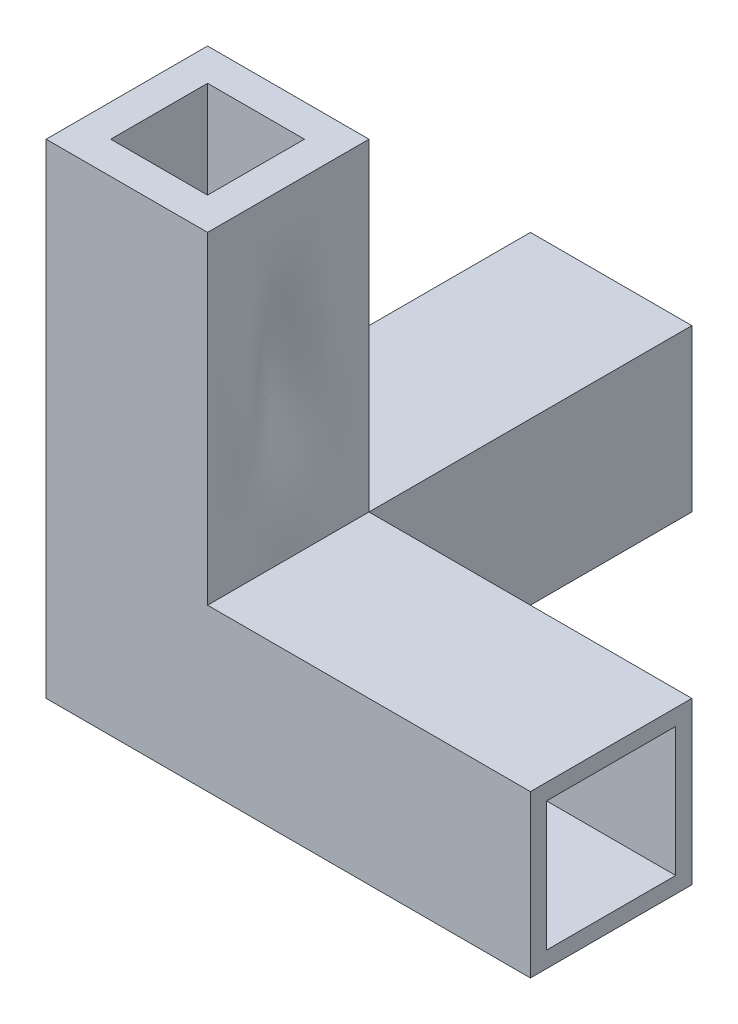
ISO-10303-21;
HEADER;
FILE_DESCRIPTION(('STEP AP214'),'2;1');
FILE_NAME('part.step','',(''),(''),'','','');
FILE_SCHEMA(('AUTOMOTIVE_DESIGN { 1 0 10303 214 1 1 1 1 }'));
ENDSEC;
DATA;
#1=APPLICATION_CONTEXT('core data for automotive mechanical design processes');
#2=APPLICATION_PROTOCOL_DEFINITION('international standard','automotive_design',2000,#1);
#3=PRODUCT_CONTEXT('',#1,'mechanical');
#4=PRODUCT('Part','Part','',(#3));
#5=PRODUCT_RELATED_PRODUCT_CATEGORY('part','',(#4));
#6=PRODUCT_DEFINITION_FORMATION('','',#4);
#7=PRODUCT_DEFINITION_CONTEXT('part definition',#1,'design');
#8=PRODUCT_DEFINITION('design','',#6,#7);
#9=PRODUCT_DEFINITION_SHAPE('','',#8);
#10=(LENGTH_UNIT() NAMED_UNIT(*) SI_UNIT(.MILLI.,.METRE.));
#11=(NAMED_UNIT(*) PLANE_ANGLE_UNIT() SI_UNIT($,.RADIAN.));
#12=(NAMED_UNIT(*) SI_UNIT($,.STERADIAN.) SOLID_ANGLE_UNIT());
#13=UNCERTAINTY_MEASURE_WITH_UNIT(LENGTH_MEASURE(1.E-05),#10,'distance_accuracy_value','');
#14=(GEOMETRIC_REPRESENTATION_CONTEXT(3) GLOBAL_UNCERTAINTY_ASSIGNED_CONTEXT((#13)) GLOBAL_UNIT_ASSIGNED_CONTEXT((#10,
#11,#12)) REPRESENTATION_CONTEXT('',''));
#15=CARTESIAN_POINT('',(0.,0.,0.));
#16=DIRECTION('',(0.,0.,1.));
#17=DIRECTION('',(1.,0.,0.));
#18=AXIS2_PLACEMENT_3D('',#15,#16,#17);
#19=CARTESIAN_POINT('',(0.,50.,0.));
#20=DIRECTION('',(1.,0.,0.));
#21=DIRECTION('',(0.,0.,-1.));
#22=AXIS2_PLACEMENT_3D('',#19,#20,#21);
#23=PLANE('',#22);
#24=DIRECTION('',(0.,-1.,0.));
#25=VECTOR('',#24,1.);
#26=CARTESIAN_POINT('',(0.,50.,-20.));
#27=LINE('',#26,#25);
#28=CARTESIAN_POINT('',(0.,50.,-20.));
#29=VERTEX_POINT('',#28);
#30=CARTESIAN_POINT('',(0.,10.,-20.));
#31=VERTEX_POINT('',#30);
#32=EDGE_CURVE('E174',#29,#31,#27,.T.);
#33=ORIENTED_EDGE('',*,*,#32,.T.);
#34=DIRECTION('',(0.,0.,1.));
#35=VECTOR('',#34,1.);
#36=CARTESIAN_POINT('',(0.,10.,-60.));
#37=LINE('',#36,#35);
#38=CARTESIAN_POINT('',(0.,10.,-60.));
#39=VERTEX_POINT('',#38);
#40=EDGE_CURVE('E222',#39,#31,#37,.T.);
#41=ORIENTED_EDGE('',*,*,#40,.F.);
#42=DIRECTION('',(0.,-1.,0.));
#43=VECTOR('',#42,1.);
#44=CARTESIAN_POINT('',(0.,10.,-60.));
#45=LINE('',#44,#43);
#46=CARTESIAN_POINT('',(0.,-10.,-60.));
#47=VERTEX_POINT('',#46);
#48=EDGE_CURVE('E635',#39,#47,#45,.T.);
#49=ORIENTED_EDGE('',*,*,#48,.T.);
#50=DIRECTION('',(0.,0.,1.));
#51=VECTOR('',#50,1.);
#52=CARTESIAN_POINT('',(0.,-10.,-60.));
#53=LINE('',#52,#51);
#54=CARTESIAN_POINT('',(0.,-10.,0.));
#55=VERTEX_POINT('',#54);
#56=EDGE_CURVE('E636',#47,#55,#53,.T.);
#57=ORIENTED_EDGE('',*,*,#56,.T.);
#58=DIRECTION('',(0.,-1.,0.));
#59=VECTOR('',#58,1.);
#60=CARTESIAN_POINT('',(0.,50.,0.));
#61=LINE('',#60,#59);
#62=CARTESIAN_POINT('',(0.,50.,0.));
#63=VERTEX_POINT('',#62);
#64=EDGE_CURVE('E13',#63,#55,#61,.T.);
#65=ORIENTED_EDGE('',*,*,#64,.F.);
#66=DIRECTION('',(0.,0.,1.));
#67=VECTOR('',#66,1.);
#68=CARTESIAN_POINT('',(0.,50.,0.));
#69=LINE('',#68,#67);
#70=EDGE_CURVE('E165',#29,#63,#69,.T.);
#71=ORIENTED_EDGE('',*,*,#70,.F.);
#72=EDGE_LOOP('',(#33,#41,#49,#57,#65,#71));
#73=FACE_BOUND('',#72,.T.);
#74=ADVANCED_FACE('F115',(#73),#23,.F.);
#75=CARTESIAN_POINT('',(0.,50.,0.));
#76=DIRECTION('',(0.,0.,-1.));
#77=DIRECTION('',(-1.,0.,0.));
#78=AXIS2_PLACEMENT_3D('',#75,#76,#77);
#79=PLANE('',#78);
#80=ORIENTED_EDGE('',*,*,#64,.T.);
#81=DIRECTION('',(1.,0.,0.));
#82=VECTOR('',#81,1.);
#83=CARTESIAN_POINT('',(0.,-10.,0.));
#84=LINE('',#83,#82);
#85=CARTESIAN_POINT('',(60.,-10.,0.));
#86=VERTEX_POINT('',#85);
#87=EDGE_CURVE('E638',#55,#86,#84,.T.);
#88=ORIENTED_EDGE('',*,*,#87,.T.);
#89=DIRECTION('',(0.,-1.,0.));
#90=VECTOR('',#89,1.);
#91=CARTESIAN_POINT('',(60.,10.,0.));
#92=LINE('',#91,#90);
#93=CARTESIAN_POINT('',(60.,10.,0.));
#94=VERTEX_POINT('',#93);
#95=EDGE_CURVE('E270',#94,#86,#92,.T.);
#96=ORIENTED_EDGE('',*,*,#95,.F.);
#97=DIRECTION('',(1.,0.,0.));
#98=VECTOR('',#97,1.);
#99=CARTESIAN_POINT('',(0.,10.,0.));
#100=LINE('',#99,#98);
#101=CARTESIAN_POINT('',(20.,10.,0.));
#102=VERTEX_POINT('',#101);
#103=EDGE_CURVE('E334',#102,#94,#100,.T.);
#104=ORIENTED_EDGE('',*,*,#103,.F.);
#105=DIRECTION('',(0.,-1.,0.));
#106=VECTOR('',#105,1.);
#107=CARTESIAN_POINT('',(20.,50.,0.));
#108=LINE('',#107,#106);
#109=CARTESIAN_POINT('',(20.,50.,0.));
#110=VERTEX_POINT('',#109);
#111=EDGE_CURVE('E128',#110,#102,#108,.T.);
#112=ORIENTED_EDGE('',*,*,#111,.F.);
#113=DIRECTION('',(1.,0.,0.));
#114=VECTOR('',#113,1.);
#115=CARTESIAN_POINT('',(0.,50.,0.));
#116=LINE('',#115,#114);
#117=EDGE_CURVE('E192',#63,#110,#116,.T.);
#118=ORIENTED_EDGE('',*,*,#117,.F.);
#119=EDGE_LOOP('',(#80,#88,#96,#104,#112,#118));
#120=FACE_BOUND('',#119,.T.);
#121=ADVANCED_FACE('F295',(#120),#79,.F.);
#122=CARTESIAN_POINT('',(20.,10.,-20.));
#123=CARTESIAN_POINT('',(20.,12.9307064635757,-20.));
#124=CARTESIAN_POINT('',(20.,18.9692027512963,-20.));
#125=CARTESIAN_POINT('',(20.,27.903954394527,-20.));
#126=CARTESIAN_POINT('',(20.,34.4233992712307,-20.));
#127=CARTESIAN_POINT('',(20.,39.6134680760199,-20.));
#128=CARTESIAN_POINT('',(20.,44.0120497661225,-20.));
#129=CARTESIAN_POINT('',(20.,47.8952317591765,-20.));
#130=CARTESIAN_POINT('',(20.,50.,-20.));
#131=CARTESIAN_POINT('',(20.,10.,-18.2021122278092));
#132=CARTESIAN_POINT('',(20.,12.9307064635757,-18.2021122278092));
#133=CARTESIAN_POINT('',(20.,18.9692027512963,-18.2021122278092));
#134=CARTESIAN_POINT('',(20.,27.903954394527,-18.2021122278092));
#135=CARTESIAN_POINT('',(20.,34.4233992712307,-18.2021122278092));
#136=CARTESIAN_POINT('',(20.,39.6134680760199,-18.2021122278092));
#137=CARTESIAN_POINT('',(20.,44.0120497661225,-18.2021122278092));
#138=CARTESIAN_POINT('',(20.,47.8952317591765,-18.2021122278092));
#139=CARTESIAN_POINT('',(20.,50.,-18.2021122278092));
#140=CARTESIAN_POINT('',(20.,10.,-14.3657053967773));
#141=CARTESIAN_POINT('',(19.8597744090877,12.9307064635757,-14.3657053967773));
#142=CARTESIAN_POINT('',(19.7045898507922,18.9692027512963,-14.3657053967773));
#143=CARTESIAN_POINT('',(21.3020199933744,27.903954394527,-14.3657053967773));
#144=CARTESIAN_POINT('',(20.7626467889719,34.4233992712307,-14.3657053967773));
#145=CARTESIAN_POINT('',(20.2680140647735,39.6134680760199,-14.3657053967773));
#146=CARTESIAN_POINT('',(19.8832273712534,44.0120497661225,-14.3657053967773));
#147=CARTESIAN_POINT('',(19.9641505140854,47.8952317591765,-14.3657053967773));
#148=CARTESIAN_POINT('',(20.,50.,-14.3657053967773));
#149=CARTESIAN_POINT('',(20.,10.,-9.6056371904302));
#150=CARTESIAN_POINT('',(20.4283073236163,12.9307064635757,-9.6056371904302));
#151=CARTESIAN_POINT('',(20.902305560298,18.9692027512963,-9.6056371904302));
#152=CARTESIAN_POINT('',(16.0230889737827,27.903954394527,-9.6056371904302));
#153=CARTESIAN_POINT('',(17.6705592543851,34.4233992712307,-9.6056371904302));
#154=CARTESIAN_POINT('',(19.1813734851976,39.6134680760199,-9.6056371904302));
#155=CARTESIAN_POINT('',(20.3566722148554,44.0120497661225,-9.6056371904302));
#156=CARTESIAN_POINT('',(20.1094992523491,47.8952317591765,-9.6056371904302));
#157=CARTESIAN_POINT('',(20.,50.,-9.6056371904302));
#158=CARTESIAN_POINT('',(20.,10.,-4.73685829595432));
#159=CARTESIAN_POINT('',(19.8205693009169,12.9307064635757,-4.73685829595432));
#160=CARTESIAN_POINT('',(19.6219973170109,18.9692027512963,-4.73685829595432));
#161=CARTESIAN_POINT('',(21.666046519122,27.903954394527,-4.73685829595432));
#162=CARTESIAN_POINT('',(20.9758721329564,34.4233992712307,-4.73685829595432));
#163=CARTESIAN_POINT('',(20.3429470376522,39.6134680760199,-4.73685829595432));
#164=CARTESIAN_POINT('',(19.8505793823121,44.0120497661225,-4.73685829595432));
#165=CARTESIAN_POINT('',(19.954127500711,47.8952317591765,-4.73685829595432));
#166=CARTESIAN_POINT('',(20.,50.,-4.73685829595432));
#167=CARTESIAN_POINT('',(20.,10.,-1.90659846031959));
#168=CARTESIAN_POINT('',(20.,12.9307064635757,-1.90659846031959));
#169=CARTESIAN_POINT('',(20.,18.9692027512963,-1.90659846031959));
#170=CARTESIAN_POINT('',(20.,27.903954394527,-1.90659846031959));
#171=CARTESIAN_POINT('',(20.,34.4233992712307,-1.90659846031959));
#172=CARTESIAN_POINT('',(20.,39.6134680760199,-1.90659846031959));
#173=CARTESIAN_POINT('',(20.,44.0120497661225,-1.90659846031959));
#174=CARTESIAN_POINT('',(20.,47.8952317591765,-1.90659846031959));
#175=CARTESIAN_POINT('',(20.,50.,-1.90659846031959));
#176=CARTESIAN_POINT('',(20.,10.,0.));
#177=CARTESIAN_POINT('',(20.,12.9307064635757,0.));
#178=CARTESIAN_POINT('',(20.,18.9692027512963,0.));
#179=CARTESIAN_POINT('',(20.,27.903954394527,0.));
#180=CARTESIAN_POINT('',(20.,34.4233992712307,0.));
#181=CARTESIAN_POINT('',(20.,39.6134680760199,0.));
#182=CARTESIAN_POINT('',(20.,44.0120497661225,0.));
#183=CARTESIAN_POINT('',(20.,47.8952317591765,0.));
#184=CARTESIAN_POINT('',(20.,50.,0.));
#185=B_SPLINE_SURFACE_WITH_KNOTS('',3,3,((#122,#123,#124,#125,#126,#127,#128,#129,#130),(#131,
#132,#133,#134,#135,#136,#137,#138,#139),(#140,#141,#142,#143,#144,#145,#146,#147,#148),(#149,
#150,#151,#152,#153,#154,#155,#156,#157),(#158,#159,#160,#161,#162,#163,#164,#165,#166),(#167,
#168,#169,#170,#171,#172,#173,#174,#175),(#176,#177,#178,#179,#180,#181,#182,#183,#184)),
.UNSPECIFIED.,.F.,.F.,.F.,(4,1,1,1,4),(4,1,1,1,1,1,4),(0.,0.269683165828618,0.575461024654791,
0.714010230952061,1.),(0.,0.219802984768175,0.452887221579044,0.670106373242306,
0.70876135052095,0.842142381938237,1.),.UNSPECIFIED.);
#186=DIRECTION('',(0.,0.,-1.));
#187=VECTOR('',#186,1.);
#188=CARTESIAN_POINT('',(20.,10.,0.));
#189=LINE('',#188,#187);
#190=CARTESIAN_POINT('',(20.,10.,-20.));
#191=VERTEX_POINT('',#190);
#192=EDGE_CURVE('E195',#102,#191,#189,.T.);
#193=DIRECTION('',(0.,-1.,0.));
#194=VECTOR('',#193,1.);
#195=CARTESIAN_POINT('',(20.,50.,-20.));
#196=LINE('',#195,#194);
#197=CARTESIAN_POINT('',(20.,50.,-20.));
#198=VERTEX_POINT('',#197);
#199=EDGE_CURVE('E187',#198,#191,#196,.T.);
#200=DIRECTION('',(0.,0.,-1.));
#201=VECTOR('',#200,1.);
#202=CARTESIAN_POINT('',(20.,50.,0.));
#203=LINE('',#202,#201);
#204=EDGE_CURVE('E168',#110,#198,#203,.T.);
#205=ORIENTED_EDGE('',*,*,#192,.T.);
#206=ORIENTED_EDGE('',*,*,#199,.F.);
#207=ORIENTED_EDGE('',*,*,#204,.F.);
#208=ORIENTED_EDGE('',*,*,#111,.T.);
#209=EDGE_LOOP('',(#205,#206,#207,#208));
#210=FACE_BOUND('',#209,.T.);
#211=ADVANCED_FACE('F284',(#210),#185,.F.);
#212=CARTESIAN_POINT('',(0.,10.,-20.));
#213=CARTESIAN_POINT('',(0.,13.0262699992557,-20.));
#214=CARTESIAN_POINT('',(0.,18.3570432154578,-20.));
#215=CARTESIAN_POINT('',(0.,26.1001935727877,-20.));
#216=CARTESIAN_POINT('',(0.,33.8997711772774,-20.));
#217=CARTESIAN_POINT('',(0.,41.9023312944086,-20.));
#218=CARTESIAN_POINT('',(0.,47.492514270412,-20.));
#219=CARTESIAN_POINT('',(0.,50.,-20.));
#220=CARTESIAN_POINT('',(1.51716428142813,10.,-20.));
#221=CARTESIAN_POINT('',(1.51716428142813,13.0262699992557,-20.));
#222=CARTESIAN_POINT('',(1.51035314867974,18.3558132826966,-19.8352138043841));
#223=CARTESIAN_POINT('',(1.53531426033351,26.1034710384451,-20.4391143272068));
#224=CARTESIAN_POINT('',(1.51059334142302,33.8985846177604,-19.8410249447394));
#225=CARTESIAN_POINT('',(1.51882722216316,41.9026315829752,-20.0402326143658));
#226=CARTESIAN_POINT('',(1.51716428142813,47.492514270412,-20.));
#227=CARTESIAN_POINT('',(1.51716428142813,50.,-20.));
#228=CARTESIAN_POINT('',(4.36571836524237,10.,-20.));
#229=CARTESIAN_POINT('',(4.36571836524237,13.0262699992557,-20.));
#230=CARTESIAN_POINT('',(4.35104602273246,18.3543937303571,-19.6450224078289));
#231=CARTESIAN_POINT('',(4.40481651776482,26.1072537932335,-20.9459272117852));
#232=CARTESIAN_POINT('',(4.3515634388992,33.8972151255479,-19.6575405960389));
#233=CARTESIAN_POINT('',(4.36930062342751,41.9029781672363,-20.0866679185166));
#234=CARTESIAN_POINT('',(4.36571836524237,47.492514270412,-20.));
#235=CARTESIAN_POINT('',(4.36571836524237,50.,-20.));
#236=CARTESIAN_POINT('',(8.39197619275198,10.,-20.));
#237=CARTESIAN_POINT('',(8.39197619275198,13.0262699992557,-20.));
#238=CARTESIAN_POINT('',(8.4418542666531,18.366050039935,-21.2067329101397));
#239=CARTESIAN_POINT('',(8.25906350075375,26.0761926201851,-16.7843561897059));
#240=CARTESIAN_POINT('',(8.4400953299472,33.9084603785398,-21.1641778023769));
#241=CARTESIAN_POINT('',(8.37979844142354,41.9001322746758,-19.7053756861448));
#242=CARTESIAN_POINT('',(8.39197619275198,47.492514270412,-20.));
#243=CARTESIAN_POINT('',(8.39197619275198,50.,-20.));
#244=CARTESIAN_POINT('',(13.5414785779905,10.,-20.));
#245=CARTESIAN_POINT('',(13.5414785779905,13.0262699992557,-20.));
#246=CARTESIAN_POINT('',(13.6617044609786,18.3787532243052,-22.9087035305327));
#247=CARTESIAN_POINT('',(13.2211064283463,26.042341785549,-12.2490267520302));
#248=CARTESIAN_POINT('',(13.6574647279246,33.9207155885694,-22.806128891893));
#249=CARTESIAN_POINT('',(13.5121253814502,41.8970307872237,-19.2898388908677));
#250=CARTESIAN_POINT('',(13.5414785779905,47.492514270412,-20.));
#251=CARTESIAN_POINT('',(13.5414785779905,50.,-20.));
#252=CARTESIAN_POINT('',(17.3595911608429,10.,-20.));
#253=CARTESIAN_POINT('',(17.3595911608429,13.0262699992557,-20.));
#254=CARTESIAN_POINT('',(17.4209420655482,18.368121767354,-21.4843026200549));
#255=CARTESIAN_POINT('',(17.1961062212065,26.0706719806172,-16.0447017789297));
#256=CARTESIAN_POINT('',(17.4187785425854,33.910459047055,-21.4319590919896));
#257=CARTESIAN_POINT('',(17.3446123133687,41.899626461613,-19.6376069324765));
#258=CARTESIAN_POINT('',(17.3595911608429,47.492514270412,-20.));
#259=CARTESIAN_POINT('',(17.3595911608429,50.,-20.));
#260=CARTESIAN_POINT('',(20.,10.,-20.));
#261=CARTESIAN_POINT('',(20.,13.0262699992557,-20.));
#262=CARTESIAN_POINT('',(20.,18.3570432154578,-20.));
#263=CARTESIAN_POINT('',(20.,26.1001935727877,-20.));
#264=CARTESIAN_POINT('',(20.,33.8997711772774,-20.));
#265=CARTESIAN_POINT('',(20.,41.9023312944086,-20.));
#266=CARTESIAN_POINT('',(20.,47.492514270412,-20.));
#267=CARTESIAN_POINT('',(20.,50.,-20.));
#268=B_SPLINE_SURFACE_WITH_KNOTS('',3,3,((#212,#213,#214,#215,#216,#217,#218,#219),(#220,#221,
#222,#223,#224,#225,#226,#227),(#228,#229,#230,#231,#232,#233,#234,#235),(#236,#237,#238,#239,
#240,#241,#242,#243),(#244,#245,#246,#247,#248,#249,#250,#251),(#252,#253,#254,#255,#256,#257,
#258,#259),(#260,#261,#262,#263,#264,#265,#266,#267)),.UNSPECIFIED.,.F.,.F.,.F.,(4,1,1,1,4),(4,
1,1,1,1,4),(0.,0.227574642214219,0.427283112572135,0.603938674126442,1.),(0.,0.226970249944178,
0.399807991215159,0.580736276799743,0.811938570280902,1.),.UNSPECIFIED.);
#269=DIRECTION('',(-1.,0.,0.));
#270=VECTOR('',#269,1.);
#271=CARTESIAN_POINT('',(0.,10.,-20.));
#272=LINE('',#271,#270);
#273=EDGE_CURVE('E182',#191,#31,#272,.T.);
#274=DIRECTION('',(-1.,0.,0.));
#275=VECTOR('',#274,1.);
#276=CARTESIAN_POINT('',(0.,50.,-20.));
#277=LINE('',#276,#275);
#278=EDGE_CURVE('E160',#198,#29,#277,.T.);
#279=ORIENTED_EDGE('',*,*,#273,.T.);
#280=ORIENTED_EDGE('',*,*,#32,.F.);
#281=ORIENTED_EDGE('',*,*,#278,.F.);
#282=ORIENTED_EDGE('',*,*,#199,.T.);
#283=EDGE_LOOP('',(#279,#280,#281,#282));
#284=FACE_BOUND('',#283,.T.);
#285=ADVANCED_FACE('F117',(#284),#268,.F.);
#286=CARTESIAN_POINT('',(0.,50.,0.));
#287=DIRECTION('',(0.,-1.,0.));
#288=DIRECTION('',(0.,0.,-1.));
#289=AXIS2_PLACEMENT_3D('',#286,#287,#288);
#290=PLANE('',#289);
#291=DIRECTION('',(0.,0.,1.));
#292=VECTOR('',#291,1.);
#293=CARTESIAN_POINT('',(4.,50.,-16.));
#294=LINE('',#293,#292);
#295=CARTESIAN_POINT('',(4.,50.,-16.));
#296=VERTEX_POINT('',#295);
#297=CARTESIAN_POINT('',(4.,50.,-4.));
#298=VERTEX_POINT('',#297);
#299=EDGE_CURVE('E751',#296,#298,#294,.T.);
#300=ORIENTED_EDGE('',*,*,#299,.F.);
#301=DIRECTION('',(-1.,0.,0.));
#302=VECTOR('',#301,1.);
#303=CARTESIAN_POINT('',(16.,50.,-16.));
#304=LINE('',#303,#302);
#305=CARTESIAN_POINT('',(16.,50.,-16.));
#306=VERTEX_POINT('',#305);
#307=EDGE_CURVE('E137',#306,#296,#304,.T.);
#308=ORIENTED_EDGE('',*,*,#307,.F.);
#309=DIRECTION('',(0.,0.,-1.));
#310=VECTOR('',#309,1.);
#311=CARTESIAN_POINT('',(16.,50.,-4.));
#312=LINE('',#311,#310);
#313=CARTESIAN_POINT('',(16.,50.,-4.));
#314=VERTEX_POINT('',#313);
#315=EDGE_CURVE('E737',#314,#306,#312,.T.);
#316=ORIENTED_EDGE('',*,*,#315,.F.);
#317=DIRECTION('',(1.,0.,0.));
#318=VECTOR('',#317,1.);
#319=CARTESIAN_POINT('',(4.,50.,-4.));
#320=LINE('',#319,#318);
#321=EDGE_CURVE('E748',#298,#314,#320,.T.);
#322=ORIENTED_EDGE('',*,*,#321,.F.);
#323=EDGE_LOOP('',(#300,#308,#316,#322));
#324=FACE_BOUND('',#323,.T.);
#325=ORIENTED_EDGE('',*,*,#70,.T.);
#326=ORIENTED_EDGE('',*,*,#117,.T.);
#327=ORIENTED_EDGE('',*,*,#204,.T.);
#328=ORIENTED_EDGE('',*,*,#278,.T.);
#329=EDGE_LOOP('',(#325,#326,#327,#328));
#330=FACE_BOUND('',#329,.T.);
#331=ADVANCED_FACE('F163',(#324,#330),#290,.F.);
#332=CARTESIAN_POINT('',(0.,10.,0.));
#333=DIRECTION('',(0.,1.,0.));
#334=DIRECTION('',(0.,0.,1.));
#335=AXIS2_PLACEMENT_3D('',#332,#333,#334);
#336=PLANE('',#335);
#337=ORIENTED_EDGE('',*,*,#273,.F.);
#338=DIRECTION('',(0.,0.,-1.));
#339=VECTOR('',#338,1.);
#340=CARTESIAN_POINT('',(20.,10.,-20.));
#341=LINE('',#340,#339);
#342=CARTESIAN_POINT('',(20.,10.,-60.));
#343=VERTEX_POINT('',#342);
#344=EDGE_CURVE('E246',#191,#343,#341,.T.);
#345=ORIENTED_EDGE('',*,*,#344,.T.);
#346=DIRECTION('',(-1.,0.,0.));
#347=VECTOR('',#346,1.);
#348=CARTESIAN_POINT('',(20.,10.,-60.));
#349=LINE('',#348,#347);
#350=EDGE_CURVE('E253',#343,#39,#349,.T.);
#351=ORIENTED_EDGE('',*,*,#350,.T.);
#352=ORIENTED_EDGE('',*,*,#40,.T.);
#353=EDGE_LOOP('',(#337,#345,#351,#352));
#354=FACE_BOUND('',#353,.T.);
#355=ADVANCED_FACE('F224',(#354),#336,.T.);
#356=ORIENTED_EDGE('',*,*,#192,.F.);
#357=ORIENTED_EDGE('',*,*,#103,.T.);
#358=DIRECTION('',(0.,0.,-1.));
#359=VECTOR('',#358,1.);
#360=CARTESIAN_POINT('',(60.,10.,0.));
#361=LINE('',#360,#359);
#362=CARTESIAN_POINT('',(60.,10.,-20.));
#363=VERTEX_POINT('',#362);
#364=EDGE_CURVE('E266',#94,#363,#361,.T.);
#365=ORIENTED_EDGE('',*,*,#364,.T.);
#366=DIRECTION('',(-1.,0.,0.));
#367=VECTOR('',#366,1.);
#368=CARTESIAN_POINT('',(60.,10.,-20.));
#369=LINE('',#368,#367);
#370=EDGE_CURVE('E254',#363,#191,#369,.T.);
#371=ORIENTED_EDGE('',*,*,#370,.T.);
#372=EDGE_LOOP('',(#356,#357,#365,#371));
#373=FACE_BOUND('',#372,.T.);
#374=ADVANCED_FACE('F234',(#373),#336,.T.);
#375=CARTESIAN_POINT('',(60.,10.,0.));
#376=DIRECTION('',(-1.,0.,0.));
#377=DIRECTION('',(0.,0.,1.));
#378=AXIS2_PLACEMENT_3D('',#375,#376,#377);
#379=PLANE('',#378);
#380=DIRECTION('',(0.,0.,-1.));
#381=VECTOR('',#380,1.);
#382=CARTESIAN_POINT('',(60.,-10.,0.));
#383=LINE('',#382,#381);
#384=CARTESIAN_POINT('',(60.,-10.,-20.));
#385=VERTEX_POINT('',#384);
#386=EDGE_CURVE('E597',#86,#385,#383,.T.);
#387=ORIENTED_EDGE('',*,*,#386,.T.);
#388=DIRECTION('',(0.,-1.,0.));
#389=VECTOR('',#388,1.);
#390=CARTESIAN_POINT('',(60.,10.,-20.));
#391=LINE('',#390,#389);
#392=EDGE_CURVE('E260',#363,#385,#391,.T.);
#393=ORIENTED_EDGE('',*,*,#392,.F.);
#394=ORIENTED_EDGE('',*,*,#364,.F.);
#395=ORIENTED_EDGE('',*,*,#95,.T.);
#396=EDGE_LOOP('',(#387,#393,#394,#395));
#397=FACE_BOUND('',#396,.T.);
#398=DIRECTION('',(0.,0.,-1.));
#399=VECTOR('',#398,1.);
#400=CARTESIAN_POINT('',(60.,-8.,0.));
#401=LINE('',#400,#399);
#402=CARTESIAN_POINT('',(60.,-8.,-2.));
#403=VERTEX_POINT('',#402);
#404=CARTESIAN_POINT('',(60.,-8.,-18.));
#405=VERTEX_POINT('',#404);
#406=EDGE_CURVE('E604',#403,#405,#401,.T.);
#407=ORIENTED_EDGE('',*,*,#406,.F.);
#408=DIRECTION('',(0.,-1.,0.));
#409=VECTOR('',#408,1.);
#410=CARTESIAN_POINT('',(60.,10.,-2.));
#411=LINE('',#410,#409);
#412=CARTESIAN_POINT('',(60.,8.,-2.));
#413=VERTEX_POINT('',#412);
#414=EDGE_CURVE('E608',#413,#403,#411,.T.);
#415=ORIENTED_EDGE('',*,*,#414,.F.);
#416=DIRECTION('',(0.,0.,-1.));
#417=VECTOR('',#416,1.);
#418=CARTESIAN_POINT('',(60.,8.,0.));
#419=LINE('',#418,#417);
#420=CARTESIAN_POINT('',(60.,8.,-18.));
#421=VERTEX_POINT('',#420);
#422=EDGE_CURVE('E629',#413,#421,#419,.T.);
#423=ORIENTED_EDGE('',*,*,#422,.T.);
#424=DIRECTION('',(0.,-1.,0.));
#425=VECTOR('',#424,1.);
#426=CARTESIAN_POINT('',(60.,10.,-18.));
#427=LINE('',#426,#425);
#428=EDGE_CURVE('E611',#421,#405,#427,.T.);
#429=ORIENTED_EDGE('',*,*,#428,.T.);
#430=EDGE_LOOP('',(#407,#415,#423,#429));
#431=FACE_BOUND('',#430,.T.);
#432=ADVANCED_FACE('F365',(#397,#431),#379,.F.);
#433=CARTESIAN_POINT('',(20.,10.,-60.));
#434=DIRECTION('',(0.,0.,1.));
#435=DIRECTION('',(1.,0.,0.));
#436=AXIS2_PLACEMENT_3D('',#433,#434,#435);
#437=PLANE('',#436);
#438=DIRECTION('',(-1.,0.,0.));
#439=VECTOR('',#438,1.);
#440=CARTESIAN_POINT('',(20.,-10.,-60.));
#441=LINE('',#440,#439);
#442=CARTESIAN_POINT('',(20.,-10.,-60.));
#443=VERTEX_POINT('',#442);
#444=EDGE_CURVE('E344',#443,#47,#441,.T.);
#445=ORIENTED_EDGE('',*,*,#444,.T.);
#446=ORIENTED_EDGE('',*,*,#48,.F.);
#447=ORIENTED_EDGE('',*,*,#350,.F.);
#448=DIRECTION('',(0.,-1.,0.));
#449=VECTOR('',#448,1.);
#450=CARTESIAN_POINT('',(20.,10.,-60.));
#451=LINE('',#450,#449);
#452=EDGE_CURVE('E261',#343,#443,#451,.T.);
#453=ORIENTED_EDGE('',*,*,#452,.T.);
#454=EDGE_LOOP('',(#445,#446,#447,#453));
#455=FACE_BOUND('',#454,.T.);
#456=DIRECTION('',(-1.,0.,0.));
#457=VECTOR('',#456,1.);
#458=CARTESIAN_POINT('',(20.,-8.,-60.));
#459=LINE('',#458,#457);
#460=CARTESIAN_POINT('',(18.,-8.,-60.));
#461=VERTEX_POINT('',#460);
#462=CARTESIAN_POINT('',(2.,-8.,-60.));
#463=VERTEX_POINT('',#462);
#464=EDGE_CURVE('E698',#461,#463,#459,.T.);
#465=ORIENTED_EDGE('',*,*,#464,.F.);
#466=DIRECTION('',(0.,-1.,0.));
#467=VECTOR('',#466,1.);
#468=CARTESIAN_POINT('',(18.,10.,-60.));
#469=LINE('',#468,#467);
#470=CARTESIAN_POINT('',(18.,8.,-60.));
#471=VERTEX_POINT('',#470);
#472=EDGE_CURVE('E701',#471,#461,#469,.T.);
#473=ORIENTED_EDGE('',*,*,#472,.F.);
#474=DIRECTION('',(-1.,0.,0.));
#475=VECTOR('',#474,1.);
#476=CARTESIAN_POINT('',(20.,8.,-60.));
#477=LINE('',#476,#475);
#478=CARTESIAN_POINT('',(2.,8.,-60.));
#479=VERTEX_POINT('',#478);
#480=EDGE_CURVE('E716',#471,#479,#477,.T.);
#481=ORIENTED_EDGE('',*,*,#480,.T.);
#482=DIRECTION('',(0.,-1.,0.));
#483=VECTOR('',#482,1.);
#484=CARTESIAN_POINT('',(2.,10.,-60.));
#485=LINE('',#484,#483);
#486=EDGE_CURVE('E704',#479,#463,#485,.T.);
#487=ORIENTED_EDGE('',*,*,#486,.T.);
#488=EDGE_LOOP('',(#465,#473,#481,#487));
#489=FACE_BOUND('',#488,.T.);
#490=ADVANCED_FACE('F422',(#455,#489),#437,.F.);
#491=CARTESIAN_POINT('',(60.,10.,-20.));
#492=DIRECTION('',(0.,0.,1.));
#493=DIRECTION('',(1.,0.,0.));
#494=AXIS2_PLACEMENT_3D('',#491,#492,#493);
#495=PLANE('',#494);
#496=DIRECTION('',(-1.,0.,0.));
#497=VECTOR('',#496,1.);
#498=CARTESIAN_POINT('',(60.,-10.,-20.));
#499=LINE('',#498,#497);
#500=CARTESIAN_POINT('',(20.,-10.,-20.));
#501=VERTEX_POINT('',#500);
#502=EDGE_CURVE('E642',#385,#501,#499,.T.);
#503=ORIENTED_EDGE('',*,*,#502,.T.);
#504=DIRECTION('',(0.,-1.,0.));
#505=VECTOR('',#504,1.);
#506=CARTESIAN_POINT('',(20.,10.,-20.));
#507=LINE('',#506,#505);
#508=EDGE_CURVE('E257',#191,#501,#507,.T.);
#509=ORIENTED_EDGE('',*,*,#508,.F.);
#510=ORIENTED_EDGE('',*,*,#370,.F.);
#511=ORIENTED_EDGE('',*,*,#392,.T.);
#512=EDGE_LOOP('',(#503,#509,#510,#511));
#513=FACE_BOUND('',#512,.T.);
#514=ADVANCED_FACE('F417',(#513),#495,.F.);
#515=CARTESIAN_POINT('',(20.,10.,-20.));
#516=DIRECTION('',(-1.,0.,0.));
#517=DIRECTION('',(0.,0.,1.));
#518=AXIS2_PLACEMENT_3D('',#515,#516,#517);
#519=PLANE('',#518);
#520=DIRECTION('',(0.,0.,-1.));
#521=VECTOR('',#520,1.);
#522=CARTESIAN_POINT('',(20.,-10.,-20.));
#523=LINE('',#522,#521);
#524=EDGE_CURVE('E645',#501,#443,#523,.T.);
#525=ORIENTED_EDGE('',*,*,#524,.T.);
#526=ORIENTED_EDGE('',*,*,#452,.F.);
#527=ORIENTED_EDGE('',*,*,#344,.F.);
#528=ORIENTED_EDGE('',*,*,#508,.T.);
#529=EDGE_LOOP('',(#525,#526,#527,#528));
#530=FACE_BOUND('',#529,.T.);
#531=ADVANCED_FACE('F421',(#530),#519,.F.);
#532=CARTESIAN_POINT('',(0.,-10.,0.));
#533=DIRECTION('',(0.,1.,0.));
#534=DIRECTION('',(0.,0.,1.));
#535=AXIS2_PLACEMENT_3D('',#532,#533,#534);
#536=PLANE('',#535);
#537=ORIENTED_EDGE('',*,*,#56,.F.);
#538=ORIENTED_EDGE('',*,*,#444,.F.);
#539=ORIENTED_EDGE('',*,*,#524,.F.);
#540=ORIENTED_EDGE('',*,*,#502,.F.);
#541=ORIENTED_EDGE('',*,*,#386,.F.);
#542=ORIENTED_EDGE('',*,*,#87,.F.);
#543=EDGE_LOOP('',(#537,#538,#539,#540,#541,#542));
#544=FACE_BOUND('',#543,.T.);
#545=ADVANCED_FACE('F237',(#544),#536,.F.);
#546=CARTESIAN_POINT('',(2.,10.,-60.));
#547=DIRECTION('',(1.,0.,0.));
#548=DIRECTION('',(0.,0.,-1.));
#549=AXIS2_PLACEMENT_3D('',#546,#547,#548);
#550=PLANE('',#549);
#551=DIRECTION('',(0.,0.,1.));
#552=VECTOR('',#551,1.);
#553=CARTESIAN_POINT('',(2.,-8.,-60.));
#554=LINE('',#553,#552);
#555=CARTESIAN_POINT('',(2.,-8.,-2.));
#556=VERTEX_POINT('',#555);
#557=EDGE_CURVE('E622',#463,#556,#554,.T.);
#558=ORIENTED_EDGE('',*,*,#557,.F.);
#559=ORIENTED_EDGE('',*,*,#486,.F.);
#560=DIRECTION('',(0.,0.,1.));
#561=VECTOR('',#560,1.);
#562=CARTESIAN_POINT('',(2.,8.,-60.));
#563=LINE('',#562,#561);
#564=CARTESIAN_POINT('',(2.,8.,-2.));
#565=VERTEX_POINT('',#564);
#566=EDGE_CURVE('E710',#479,#565,#563,.T.);
#567=ORIENTED_EDGE('',*,*,#566,.T.);
#568=DIRECTION('',(0.,-1.,0.));
#569=VECTOR('',#568,1.);
#570=CARTESIAN_POINT('',(2.,10.,-2.));
#571=LINE('',#570,#569);
#572=EDGE_CURVE('E639',#565,#556,#571,.T.);
#573=ORIENTED_EDGE('',*,*,#572,.T.);
#574=EDGE_LOOP('',(#558,#559,#567,#573));
#575=FACE_BOUND('',#574,.T.);
#576=ADVANCED_FACE('F438',(#575),#550,.T.);
#577=CARTESIAN_POINT('',(0.,10.,-2.));
#578=DIRECTION('',(0.,0.,-1.));
#579=DIRECTION('',(-1.,0.,0.));
#580=AXIS2_PLACEMENT_3D('',#577,#578,#579);
#581=PLANE('',#580);
#582=DIRECTION('',(1.,0.,0.));
#583=VECTOR('',#582,1.);
#584=CARTESIAN_POINT('',(0.,-8.,-2.));
#585=LINE('',#584,#583);
#586=EDGE_CURVE('E618',#556,#403,#585,.T.);
#587=ORIENTED_EDGE('',*,*,#586,.F.);
#588=ORIENTED_EDGE('',*,*,#572,.F.);
#589=DIRECTION('',(1.,0.,0.));
#590=VECTOR('',#589,1.);
#591=CARTESIAN_POINT('',(0.,8.,-2.));
#592=LINE('',#591,#590);
#593=EDGE_CURVE('E631',#565,#413,#592,.T.);
#594=ORIENTED_EDGE('',*,*,#593,.T.);
#595=ORIENTED_EDGE('',*,*,#414,.T.);
#596=EDGE_LOOP('',(#587,#588,#594,#595));
#597=FACE_BOUND('',#596,.T.);
#598=ADVANCED_FACE('F444',(#597),#581,.T.);
#599=CARTESIAN_POINT('',(60.,10.,-18.));
#600=DIRECTION('',(0.,0.,1.));
#601=DIRECTION('',(1.,0.,0.));
#602=AXIS2_PLACEMENT_3D('',#599,#600,#601);
#603=PLANE('',#602);
#604=DIRECTION('',(-1.,0.,0.));
#605=VECTOR('',#604,1.);
#606=CARTESIAN_POINT('',(60.,-8.,-18.));
#607=LINE('',#606,#605);
#608=CARTESIAN_POINT('',(18.,-8.,-18.));
#609=VERTEX_POINT('',#608);
#610=EDGE_CURVE('E617',#405,#609,#607,.T.);
#611=ORIENTED_EDGE('',*,*,#610,.F.);
#612=ORIENTED_EDGE('',*,*,#428,.F.);
#613=DIRECTION('',(-1.,0.,0.));
#614=VECTOR('',#613,1.);
#615=CARTESIAN_POINT('',(60.,8.,-18.));
#616=LINE('',#615,#614);
#617=CARTESIAN_POINT('',(18.,8.,-18.));
#618=VERTEX_POINT('',#617);
#619=EDGE_CURVE('E630',#421,#618,#616,.T.);
#620=ORIENTED_EDGE('',*,*,#619,.T.);
#621=DIRECTION('',(0.,-1.,0.));
#622=VECTOR('',#621,1.);
#623=CARTESIAN_POINT('',(18.,10.,-18.));
#624=LINE('',#623,#622);
#625=EDGE_CURVE('E628',#618,#609,#624,.T.);
#626=ORIENTED_EDGE('',*,*,#625,.T.);
#627=EDGE_LOOP('',(#611,#612,#620,#626));
#628=FACE_BOUND('',#627,.T.);
#629=ADVANCED_FACE('F451',(#628),#603,.T.);
#630=CARTESIAN_POINT('',(18.,10.,-20.));
#631=DIRECTION('',(-1.,0.,0.));
#632=DIRECTION('',(0.,0.,1.));
#633=AXIS2_PLACEMENT_3D('',#630,#631,#632);
#634=PLANE('',#633);
#635=DIRECTION('',(0.,0.,-1.));
#636=VECTOR('',#635,1.);
#637=CARTESIAN_POINT('',(18.,-8.,-20.));
#638=LINE('',#637,#636);
#639=EDGE_CURVE('E620',#609,#461,#638,.T.);
#640=ORIENTED_EDGE('',*,*,#639,.F.);
#641=ORIENTED_EDGE('',*,*,#625,.F.);
#642=DIRECTION('',(0.,0.,-1.));
#643=VECTOR('',#642,1.);
#644=CARTESIAN_POINT('',(18.,8.,-20.));
#645=LINE('',#644,#643);
#646=EDGE_CURVE('E718',#618,#471,#645,.T.);
#647=ORIENTED_EDGE('',*,*,#646,.T.);
#648=ORIENTED_EDGE('',*,*,#472,.T.);
#649=EDGE_LOOP('',(#640,#641,#647,#648));
#650=FACE_BOUND('',#649,.T.);
#651=ADVANCED_FACE('F458',(#650),#634,.T.);
#652=CARTESIAN_POINT('',(0.,8.,0.));
#653=DIRECTION('',(0.,1.,0.));
#654=DIRECTION('',(0.,0.,1.));
#655=AXIS2_PLACEMENT_3D('',#652,#653,#654);
#656=PLANE('',#655);
#657=DIRECTION('',(0.,0.,1.));
#658=VECTOR('',#657,1.);
#659=CARTESIAN_POINT('',(16.,8.,-4.));
#660=LINE('',#659,#658);
#661=CARTESIAN_POINT('',(16.,8.,-16.));
#662=VERTEX_POINT('',#661);
#663=CARTESIAN_POINT('',(16.,8.,-4.));
#664=VERTEX_POINT('',#663);
#665=EDGE_CURVE('E757',#662,#664,#660,.T.);
#666=ORIENTED_EDGE('',*,*,#665,.F.);
#667=DIRECTION('',(1.,0.,0.));
#668=VECTOR('',#667,1.);
#669=CARTESIAN_POINT('',(16.,8.,-16.));
#670=LINE('',#669,#668);
#671=CARTESIAN_POINT('',(4.,8.,-16.));
#672=VERTEX_POINT('',#671);
#673=EDGE_CURVE('E733',#672,#662,#670,.T.);
#674=ORIENTED_EDGE('',*,*,#673,.F.);
#675=DIRECTION('',(0.,0.,-1.));
#676=VECTOR('',#675,1.);
#677=CARTESIAN_POINT('',(4.,8.,-16.));
#678=LINE('',#677,#676);
#679=CARTESIAN_POINT('',(4.,8.,-4.));
#680=VERTEX_POINT('',#679);
#681=EDGE_CURVE('E730',#680,#672,#678,.T.);
#682=ORIENTED_EDGE('',*,*,#681,.F.);
#683=DIRECTION('',(-1.,0.,0.));
#684=VECTOR('',#683,1.);
#685=CARTESIAN_POINT('',(4.,8.,-4.));
#686=LINE('',#685,#684);
#687=EDGE_CURVE('E745',#664,#680,#686,.T.);
#688=ORIENTED_EDGE('',*,*,#687,.F.);
#689=EDGE_LOOP('',(#666,#674,#682,#688));
#690=FACE_BOUND('',#689,.T.);
#691=ORIENTED_EDGE('',*,*,#566,.F.);
#692=ORIENTED_EDGE('',*,*,#480,.F.);
#693=ORIENTED_EDGE('',*,*,#646,.F.);
#694=ORIENTED_EDGE('',*,*,#619,.F.);
#695=ORIENTED_EDGE('',*,*,#422,.F.);
#696=ORIENTED_EDGE('',*,*,#593,.F.);
#697=EDGE_LOOP('',(#691,#692,#693,#694,#695,#696));
#698=FACE_BOUND('',#697,.T.);
#699=ADVANCED_FACE('F465',(#690,#698),#656,.F.);
#700=CARTESIAN_POINT('',(0.,-8.,0.));
#701=DIRECTION('',(0.,1.,0.));
#702=DIRECTION('',(0.,0.,1.));
#703=AXIS2_PLACEMENT_3D('',#700,#701,#702);
#704=PLANE('',#703);
#705=ORIENTED_EDGE('',*,*,#557,.T.);
#706=ORIENTED_EDGE('',*,*,#586,.T.);
#707=ORIENTED_EDGE('',*,*,#406,.T.);
#708=ORIENTED_EDGE('',*,*,#610,.T.);
#709=ORIENTED_EDGE('',*,*,#639,.T.);
#710=ORIENTED_EDGE('',*,*,#464,.T.);
#711=EDGE_LOOP('',(#705,#706,#707,#708,#709,#710));
#712=FACE_BOUND('',#711,.T.);
#713=ADVANCED_FACE('F235',(#712),#704,.T.);
#714=CARTESIAN_POINT('',(16.,-8.97056274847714,-16.));
#715=DIRECTION('',(0.,0.,-1.));
#716=DIRECTION('',(-1.,0.,0.));
#717=AXIS2_PLACEMENT_3D('',#714,#715,#716);
#718=PLANE('',#717);
#719=ORIENTED_EDGE('',*,*,#673,.T.);
#720=DIRECTION('',(0.,1.,0.));
#721=VECTOR('',#720,1.);
#722=CARTESIAN_POINT('',(16.,-8.97056274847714,-16.));
#723=LINE('',#722,#721);
#724=EDGE_CURVE('E743',#662,#306,#723,.T.);
#725=ORIENTED_EDGE('',*,*,#724,.T.);
#726=ORIENTED_EDGE('',*,*,#307,.T.);
#727=DIRECTION('',(0.,1.,0.));
#728=VECTOR('',#727,1.);
#729=CARTESIAN_POINT('',(4.,-8.97056274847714,-16.));
#730=LINE('',#729,#728);
#731=EDGE_CURVE('E734',#672,#296,#730,.T.);
#732=ORIENTED_EDGE('',*,*,#731,.F.);
#733=EDGE_LOOP('',(#719,#725,#726,#732));
#734=FACE_BOUND('',#733,.T.);
#735=ADVANCED_FACE('F480',(#734),#718,.F.);
#736=CARTESIAN_POINT('',(16.,-8.97056274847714,-4.));
#737=DIRECTION('',(1.,0.,0.));
#738=DIRECTION('',(0.,0.,-1.));
#739=AXIS2_PLACEMENT_3D('',#736,#737,#738);
#740=PLANE('',#739);
#741=ORIENTED_EDGE('',*,*,#665,.T.);
#742=DIRECTION('',(0.,1.,0.));
#743=VECTOR('',#742,1.);
#744=CARTESIAN_POINT('',(16.,-8.97056274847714,-4.));
#745=LINE('',#744,#743);
#746=EDGE_CURVE('E740',#664,#314,#745,.T.);
#747=ORIENTED_EDGE('',*,*,#746,.T.);
#748=ORIENTED_EDGE('',*,*,#315,.T.);
#749=ORIENTED_EDGE('',*,*,#724,.F.);
#750=EDGE_LOOP('',(#741,#747,#748,#749));
#751=FACE_BOUND('',#750,.T.);
#752=ADVANCED_FACE('F484',(#751),#740,.F.);
#753=CARTESIAN_POINT('',(4.,-8.97056274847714,-4.));
#754=DIRECTION('',(0.,0.,1.));
#755=DIRECTION('',(1.,0.,0.));
#756=AXIS2_PLACEMENT_3D('',#753,#754,#755);
#757=PLANE('',#756);
#758=ORIENTED_EDGE('',*,*,#687,.T.);
#759=DIRECTION('',(0.,1.,0.));
#760=VECTOR('',#759,1.);
#761=CARTESIAN_POINT('',(4.,-8.97056274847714,-4.));
#762=LINE('',#761,#760);
#763=EDGE_CURVE('E736',#680,#298,#762,.T.);
#764=ORIENTED_EDGE('',*,*,#763,.T.);
#765=ORIENTED_EDGE('',*,*,#321,.T.);
#766=ORIENTED_EDGE('',*,*,#746,.F.);
#767=EDGE_LOOP('',(#758,#764,#765,#766));
#768=FACE_BOUND('',#767,.T.);
#769=ADVANCED_FACE('F491',(#768),#757,.F.);
#770=CARTESIAN_POINT('',(4.,-8.97056274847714,-16.));
#771=DIRECTION('',(-1.,0.,0.));
#772=DIRECTION('',(0.,0.,1.));
#773=AXIS2_PLACEMENT_3D('',#770,#771,#772);
#774=PLANE('',#773);
#775=ORIENTED_EDGE('',*,*,#681,.T.);
#776=ORIENTED_EDGE('',*,*,#731,.T.);
#777=ORIENTED_EDGE('',*,*,#299,.T.);
#778=ORIENTED_EDGE('',*,*,#763,.F.);
#779=EDGE_LOOP('',(#775,#776,#777,#778));
#780=FACE_BOUND('',#779,.T.);
#781=ADVANCED_FACE('F499',(#780),#774,.F.);
#782=CLOSED_SHELL('',(#74,#121,#211,#285,#331,#355,#374,#432,#490,#514,#531,#545,#576,#598,#629,
#651,#699,#713,#735,#752,#769,#781));
#783=MANIFOLD_SOLID_BREP('B2',#782);
#784=ADVANCED_BREP_SHAPE_REPRESENTATION('',(#18,#783),#14);
#785=SHAPE_DEFINITION_REPRESENTATION(#9,#784);
ENDSEC;
END-ISO-10303-21;
